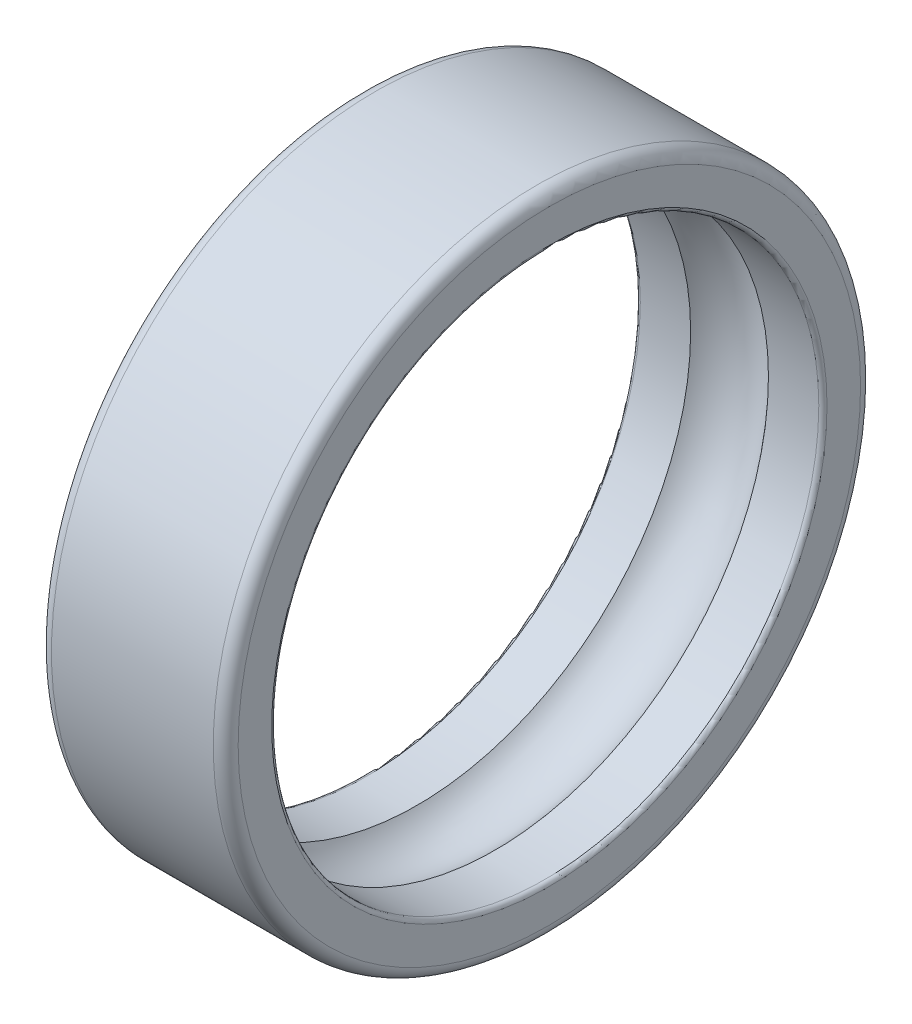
ISO-10303-21;
HEADER;
FILE_DESCRIPTION(('STEP AP214'),'2;1');
FILE_NAME('part.step','',(''),(''),'','','');
FILE_SCHEMA(('AUTOMOTIVE_DESIGN { 1 0 10303 214 1 1 1 1 }'));
ENDSEC;
DATA;
#1=APPLICATION_CONTEXT('core data for automotive mechanical design processes');
#2=APPLICATION_PROTOCOL_DEFINITION('international standard','automotive_design',2000,#1);
#3=PRODUCT_CONTEXT('',#1,'mechanical');
#4=PRODUCT('Part','Part','',(#3));
#5=PRODUCT_RELATED_PRODUCT_CATEGORY('part','',(#4));
#6=PRODUCT_DEFINITION_FORMATION('','',#4);
#7=PRODUCT_DEFINITION_CONTEXT('part definition',#1,'design');
#8=PRODUCT_DEFINITION('design','',#6,#7);
#9=PRODUCT_DEFINITION_SHAPE('','',#8);
#10=(LENGTH_UNIT() NAMED_UNIT(*) SI_UNIT(.MILLI.,.METRE.));
#11=(NAMED_UNIT(*) PLANE_ANGLE_UNIT() SI_UNIT($,.RADIAN.));
#12=(NAMED_UNIT(*) SI_UNIT($,.STERADIAN.) SOLID_ANGLE_UNIT());
#13=UNCERTAINTY_MEASURE_WITH_UNIT(LENGTH_MEASURE(1.E-05),#10,'distance_accuracy_value','');
#14=(GEOMETRIC_REPRESENTATION_CONTEXT(3) GLOBAL_UNCERTAINTY_ASSIGNED_CONTEXT((#13)) GLOBAL_UNIT_ASSIGNED_CONTEXT((#10,
#11,#12)) REPRESENTATION_CONTEXT('',''));
#15=CARTESIAN_POINT('',(0.,0.,0.));
#16=DIRECTION('',(0.,0.,1.));
#17=DIRECTION('',(1.,0.,0.));
#18=AXIS2_PLACEMENT_3D('',#15,#16,#17);
#19=CARTESIAN_POINT('',(14.67,0.,0.));
#20=DIRECTION('',(1.,0.,0.));
#21=DIRECTION('',(0.,0.,-1.));
#22=AXIS2_PLACEMENT_3D('',#19,#20,#21);
#23=TOROIDAL_SURFACE('',#22,22.305,0.33);
#24=CARTESIAN_POINT('',(15.,0.,0.));
#25=DIRECTION('',(1.,0.,0.));
#26=DIRECTION('',(0.,0.,-1.));
#27=AXIS2_PLACEMENT_3D('',#24,#25,#26);
#28=CIRCLE('',#27,22.305);
#29=CARTESIAN_POINT('',(15.,0.,-22.305));
#30=VERTEX_POINT('',#29);
#31=EDGE_CURVE('E10',#30,#30,#28,.T.);
#32=ORIENTED_EDGE('',*,*,#31,.T.);
#33=EDGE_LOOP('',(#32));
#34=FACE_BOUND('',#33,.T.);
#35=CARTESIAN_POINT('',(14.67,0.,0.));
#36=DIRECTION('',(1.,0.,0.));
#37=DIRECTION('',(0.,0.,-1.));
#38=AXIS2_PLACEMENT_3D('',#35,#36,#37);
#39=CIRCLE('',#38,21.975);
#40=CARTESIAN_POINT('',(14.67,0.,-21.975));
#41=VERTEX_POINT('',#40);
#42=EDGE_CURVE('E68',#41,#41,#39,.T.);
#43=ORIENTED_EDGE('',*,*,#42,.F.);
#44=EDGE_LOOP('',(#43));
#45=FACE_BOUND('',#44,.T.);
#46=ADVANCED_FACE('F34',(#34,#45),#23,.T.);
#47=CARTESIAN_POINT('',(15.,22.305,0.));
#48=DIRECTION('',(1.,0.,0.));
#49=DIRECTION('',(0.,0.,-1.));
#50=AXIS2_PLACEMENT_3D('',#47,#48,#49);
#51=PLANE('',#50);
#52=CARTESIAN_POINT('',(15.,0.,0.));
#53=DIRECTION('',(1.,0.,0.));
#54=DIRECTION('',(0.,0.,-1.));
#55=AXIS2_PLACEMENT_3D('',#52,#53,#54);
#56=CIRCLE('',#55,25.);
#57=CARTESIAN_POINT('',(15.,0.,-25.));
#58=VERTEX_POINT('',#57);
#59=EDGE_CURVE('E40',#58,#58,#56,.T.);
#60=ORIENTED_EDGE('',*,*,#59,.T.);
#61=EDGE_LOOP('',(#60));
#62=FACE_BOUND('',#61,.T.);
#63=ORIENTED_EDGE('',*,*,#31,.F.);
#64=EDGE_LOOP('',(#63));
#65=FACE_BOUND('',#64,.T.);
#66=ADVANCED_FACE('F76',(#62,#65),#51,.T.);
#67=CARTESIAN_POINT('',(14.,0.,0.));
#68=DIRECTION('',(1.,0.,0.));
#69=DIRECTION('',(0.,0.,-1.));
#70=AXIS2_PLACEMENT_3D('',#67,#68,#69);
#71=TOROIDAL_SURFACE('',#70,25.,1.);
#72=CARTESIAN_POINT('',(14.,0.,0.));
#73=DIRECTION('',(1.,0.,0.));
#74=DIRECTION('',(0.,0.,-1.));
#75=AXIS2_PLACEMENT_3D('',#72,#73,#74);
#76=CIRCLE('',#75,26.);
#77=CARTESIAN_POINT('',(14.,0.,-26.));
#78=VERTEX_POINT('',#77);
#79=EDGE_CURVE('E44',#78,#78,#76,.T.);
#80=ORIENTED_EDGE('',*,*,#79,.T.);
#81=EDGE_LOOP('',(#80));
#82=FACE_BOUND('',#81,.T.);
#83=ORIENTED_EDGE('',*,*,#59,.F.);
#84=EDGE_LOOP('',(#83));
#85=FACE_BOUND('',#84,.T.);
#86=ADVANCED_FACE('F80',(#82,#85),#71,.T.);
#87=CARTESIAN_POINT('',(91.4363576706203,0.,0.));
#88=DIRECTION('',(1.,0.,0.));
#89=DIRECTION('',(0.,0.,-1.));
#90=AXIS2_PLACEMENT_3D('',#87,#88,#89);
#91=CYLINDRICAL_SURFACE('',#90,26.);
#92=CARTESIAN_POINT('',(1.,0.,0.));
#93=DIRECTION('',(1.,0.,0.));
#94=DIRECTION('',(0.,0.,-1.));
#95=AXIS2_PLACEMENT_3D('',#92,#93,#94);
#96=CIRCLE('',#95,26.);
#97=CARTESIAN_POINT('',(1.,0.,-26.));
#98=VERTEX_POINT('',#97);
#99=EDGE_CURVE('E48',#98,#98,#96,.T.);
#100=ORIENTED_EDGE('',*,*,#99,.T.);
#101=EDGE_LOOP('',(#100));
#102=FACE_BOUND('',#101,.T.);
#103=ORIENTED_EDGE('',*,*,#79,.F.);
#104=EDGE_LOOP('',(#103));
#105=FACE_BOUND('',#104,.T.);
#106=ADVANCED_FACE('F84',(#102,#105),#91,.T.);
#107=CARTESIAN_POINT('',(1.,0.,0.));
#108=DIRECTION('',(1.,0.,0.));
#109=DIRECTION('',(0.,0.,-1.));
#110=AXIS2_PLACEMENT_3D('',#107,#108,#109);
#111=TOROIDAL_SURFACE('',#110,25.,1.);
#112=CARTESIAN_POINT('',(0.,0.,0.));
#113=DIRECTION('',(1.,0.,0.));
#114=DIRECTION('',(0.,0.,-1.));
#115=AXIS2_PLACEMENT_3D('',#112,#113,#114);
#116=CIRCLE('',#115,25.);
#117=CARTESIAN_POINT('',(0.,0.,-25.));
#118=VERTEX_POINT('',#117);
#119=EDGE_CURVE('E53',#118,#118,#116,.T.);
#120=ORIENTED_EDGE('',*,*,#119,.T.);
#121=EDGE_LOOP('',(#120));
#122=FACE_BOUND('',#121,.T.);
#123=ORIENTED_EDGE('',*,*,#99,.F.);
#124=EDGE_LOOP('',(#123));
#125=FACE_BOUND('',#124,.T.);
#126=ADVANCED_FACE('F91',(#122,#125),#111,.T.);
#127=CARTESIAN_POINT('',(0.,25.,0.));
#128=DIRECTION('',(-1.,0.,0.));
#129=DIRECTION('',(0.,0.,1.));
#130=AXIS2_PLACEMENT_3D('',#127,#128,#129);
#131=PLANE('',#130);
#132=CARTESIAN_POINT('',(0.,0.,0.));
#133=DIRECTION('',(1.,0.,0.));
#134=DIRECTION('',(0.,0.,-1.));
#135=AXIS2_PLACEMENT_3D('',#132,#133,#134);
#136=CIRCLE('',#135,22.305);
#137=CARTESIAN_POINT('',(0.,0.,-22.305));
#138=VERTEX_POINT('',#137);
#139=EDGE_CURVE('E56',#138,#138,#136,.T.);
#140=ORIENTED_EDGE('',*,*,#139,.T.);
#141=EDGE_LOOP('',(#140));
#142=FACE_BOUND('',#141,.T.);
#143=ORIENTED_EDGE('',*,*,#119,.F.);
#144=EDGE_LOOP('',(#143));
#145=FACE_BOUND('',#144,.T.);
#146=ADVANCED_FACE('F95',(#142,#145),#131,.T.);
#147=CARTESIAN_POINT('',(0.33,0.,0.));
#148=DIRECTION('',(1.,0.,0.));
#149=DIRECTION('',(0.,0.,-1.));
#150=AXIS2_PLACEMENT_3D('',#147,#148,#149);
#151=TOROIDAL_SURFACE('',#150,22.305,0.33);
#152=CARTESIAN_POINT('',(0.329999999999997,0.,0.));
#153=DIRECTION('',(1.,0.,0.));
#154=DIRECTION('',(0.,0.,-1.));
#155=AXIS2_PLACEMENT_3D('',#152,#153,#154);
#156=CIRCLE('',#155,21.975);
#157=CARTESIAN_POINT('',(0.329999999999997,0.,-21.975));
#158=VERTEX_POINT('',#157);
#159=EDGE_CURVE('E59',#158,#158,#156,.T.);
#160=ORIENTED_EDGE('',*,*,#159,.T.);
#161=EDGE_LOOP('',(#160));
#162=FACE_BOUND('',#161,.T.);
#163=ORIENTED_EDGE('',*,*,#139,.F.);
#164=EDGE_LOOP('',(#163));
#165=FACE_BOUND('',#164,.T.);
#166=ADVANCED_FACE('F99',(#162,#165),#151,.T.);
#167=CARTESIAN_POINT('',(91.4363576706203,0.,0.));
#168=DIRECTION('',(1.,0.,0.));
#169=DIRECTION('',(0.,0.,-1.));
#170=AXIS2_PLACEMENT_3D('',#167,#168,#169);
#171=CYLINDRICAL_SURFACE('',#170,21.975);
#172=CARTESIAN_POINT('',(4.375,0.,0.));
#173=DIRECTION('',(1.,0.,0.));
#174=DIRECTION('',(0.,0.,-1.));
#175=AXIS2_PLACEMENT_3D('',#172,#173,#174);
#176=CIRCLE('',#175,21.975);
#177=CARTESIAN_POINT('',(4.375,0.,-21.975));
#178=VERTEX_POINT('',#177);
#179=EDGE_CURVE('E62',#178,#178,#176,.T.);
#180=ORIENTED_EDGE('',*,*,#179,.T.);
#181=EDGE_LOOP('',(#180));
#182=FACE_BOUND('',#181,.T.);
#183=ORIENTED_EDGE('',*,*,#159,.F.);
#184=EDGE_LOOP('',(#183));
#185=FACE_BOUND('',#184,.T.);
#186=ADVANCED_FACE('F103',(#182,#185),#171,.F.);
#187=CARTESIAN_POINT('',(7.5,0.,0.));
#188=DIRECTION('',(1.,0.,0.));
#189=DIRECTION('',(0.,0.,-1.));
#190=AXIS2_PLACEMENT_3D('',#187,#188,#189);
#191=TOROIDAL_SURFACE('',#190,19.5280966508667,3.969);
#192=CARTESIAN_POINT('',(10.625,0.,0.));
#193=DIRECTION('',(1.,0.,0.));
#194=DIRECTION('',(0.,0.,-1.));
#195=AXIS2_PLACEMENT_3D('',#192,#193,#194);
#196=CIRCLE('',#195,21.975);
#197=CARTESIAN_POINT('',(10.625,0.,-21.975));
#198=VERTEX_POINT('',#197);
#199=EDGE_CURVE('E65',#198,#198,#196,.T.);
#200=ORIENTED_EDGE('',*,*,#199,.T.);
#201=EDGE_LOOP('',(#200));
#202=FACE_BOUND('',#201,.T.);
#203=ORIENTED_EDGE('',*,*,#179,.F.);
#204=EDGE_LOOP('',(#203));
#205=FACE_BOUND('',#204,.T.);
#206=ADVANCED_FACE('F107',(#202,#205),#191,.F.);
#207=CARTESIAN_POINT('',(91.4363576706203,0.,0.));
#208=DIRECTION('',(1.,0.,0.));
#209=DIRECTION('',(0.,0.,-1.));
#210=AXIS2_PLACEMENT_3D('',#207,#208,#209);
#211=CYLINDRICAL_SURFACE('',#210,21.975);
#212=ORIENTED_EDGE('',*,*,#42,.T.);
#213=EDGE_LOOP('',(#212));
#214=FACE_BOUND('',#213,.T.);
#215=ORIENTED_EDGE('',*,*,#199,.F.);
#216=EDGE_LOOP('',(#215));
#217=FACE_BOUND('',#216,.T.);
#218=ADVANCED_FACE('F72',(#214,#217),#211,.F.);
#219=CLOSED_SHELL('',(#46,#66,#86,#106,#126,#146,#166,#186,#206,#218));
#220=MANIFOLD_SOLID_BREP('B2',#219);
#221=ADVANCED_BREP_SHAPE_REPRESENTATION('',(#18,#220),#14);
#222=SHAPE_DEFINITION_REPRESENTATION(#9,#221);
ENDSEC;
END-ISO-10303-21;
